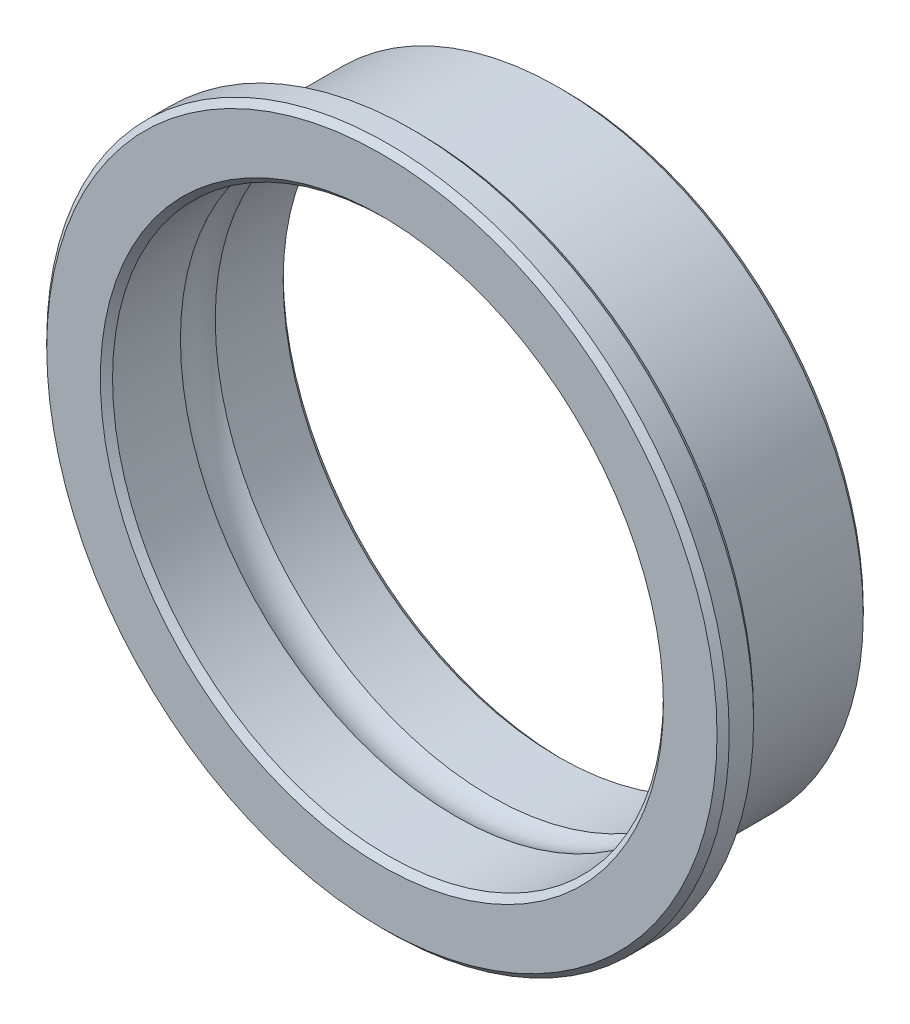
ISO-10303-21;
HEADER;
FILE_DESCRIPTION(('STEP AP214'),'2;1');
FILE_NAME('part.step','',(''),(''),'','','');
FILE_SCHEMA(('AUTOMOTIVE_DESIGN { 1 0 10303 214 1 1 1 1 }'));
ENDSEC;
DATA;
#1=APPLICATION_CONTEXT('core data for automotive mechanical design processes');
#2=APPLICATION_PROTOCOL_DEFINITION('international standard','automotive_design',2000,#1);
#3=PRODUCT_CONTEXT('',#1,'mechanical');
#4=PRODUCT('Part','Part','',(#3));
#5=PRODUCT_RELATED_PRODUCT_CATEGORY('part','',(#4));
#6=PRODUCT_DEFINITION_FORMATION('','',#4);
#7=PRODUCT_DEFINITION_CONTEXT('part definition',#1,'design');
#8=PRODUCT_DEFINITION('design','',#6,#7);
#9=PRODUCT_DEFINITION_SHAPE('','',#8);
#10=(LENGTH_UNIT() NAMED_UNIT(*) SI_UNIT(.MILLI.,.METRE.));
#11=(NAMED_UNIT(*) PLANE_ANGLE_UNIT() SI_UNIT($,.RADIAN.));
#12=(NAMED_UNIT(*) SI_UNIT($,.STERADIAN.) SOLID_ANGLE_UNIT());
#13=UNCERTAINTY_MEASURE_WITH_UNIT(LENGTH_MEASURE(1.E-05),#10,'distance_accuracy_value','');
#14=(GEOMETRIC_REPRESENTATION_CONTEXT(3) GLOBAL_UNCERTAINTY_ASSIGNED_CONTEXT((#13)) GLOBAL_UNIT_ASSIGNED_CONTEXT((#10,
#11,#12)) REPRESENTATION_CONTEXT('',''));
#15=CARTESIAN_POINT('',(0.,0.,0.));
#16=DIRECTION('',(0.,0.,1.));
#17=DIRECTION('',(1.,0.,0.));
#18=AXIS2_PLACEMENT_3D('',#15,#16,#17);
#19=CARTESIAN_POINT('',(0.,0.,0.));
#20=DIRECTION('',(0.,0.,1.));
#21=DIRECTION('',(1.,0.,0.));
#22=AXIS2_PLACEMENT_3D('',#19,#20,#21);
#23=CYLINDRICAL_SURFACE('',#22,4.52);
#24=CARTESIAN_POINT('',(0.,0.,1.40000000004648));
#25=DIRECTION('',(0.,0.,1.));
#26=DIRECTION('',(1.,0.,0.));
#27=AXIS2_PLACEMENT_3D('',#24,#25,#26);
#28=CIRCLE('',#27,4.52000000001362);
#29=CARTESIAN_POINT('',(4.52000000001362,0.,1.40000000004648));
#30=VERTEX_POINT('',#29);
#31=EDGE_CURVE('E32',#30,#30,#28,.T.);
#32=ORIENTED_EDGE('',*,*,#31,.T.);
#33=EDGE_LOOP('',(#32));
#34=FACE_BOUND('',#33,.T.);
#35=CARTESIAN_POINT('',(0.,0.,0.285681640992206));
#36=DIRECTION('',(0.,0.,1.));
#37=DIRECTION('',(1.,0.,0.));
#38=AXIS2_PLACEMENT_3D('',#35,#36,#37);
#39=CIRCLE('',#38,4.52);
#40=CARTESIAN_POINT('',(4.52,0.,0.285681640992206));
#41=VERTEX_POINT('',#40);
#42=EDGE_CURVE('E56',#41,#41,#39,.F.);
#43=ORIENTED_EDGE('',*,*,#42,.T.);
#44=EDGE_LOOP('',(#43));
#45=FACE_BOUND('',#44,.T.);
#46=ADVANCED_FACE('F15',(#34,#45),#23,.F.);
#47=CARTESIAN_POINT('',(0.,0.,1.49999999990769));
#48=DIRECTION('',(0.,0.,1.));
#49=DIRECTION('',(1.,0.,0.));
#50=AXIS2_PLACEMENT_3D('',#47,#48,#49);
#51=CONICAL_SURFACE('',#50,4.61999999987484,0.785398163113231);
#52=CARTESIAN_POINT('',(0.,0.,1.49999999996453));
#53=DIRECTION('',(0.,0.,1.));
#54=DIRECTION('',(1.,0.,0.));
#55=AXIS2_PLACEMENT_3D('',#52,#53,#54);
#56=CIRCLE('',#55,4.61999999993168);
#57=CARTESIAN_POINT('',(4.61999999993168,0.,1.49999999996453));
#58=VERTEX_POINT('',#57);
#59=EDGE_CURVE('E19',#58,#58,#56,.T.);
#60=ORIENTED_EDGE('',*,*,#59,.T.);
#61=EDGE_LOOP('',(#60));
#62=FACE_BOUND('',#61,.T.);
#63=ORIENTED_EDGE('',*,*,#31,.F.);
#64=EDGE_LOOP('',(#63));
#65=FACE_BOUND('',#64,.T.);
#66=ADVANCED_FACE('F65',(#62,#65),#51,.F.);
#67=CARTESIAN_POINT('',(0.,0.,0.));
#68=DIRECTION('',(0.,0.,1.));
#69=DIRECTION('',(1.,0.,0.));
#70=AXIS2_PLACEMENT_3D('',#67,#68,#69);
#71=TOROIDAL_SURFACE('',#70,3.9975,0.5955);
#72=ORIENTED_EDGE('',*,*,#42,.F.);
#73=EDGE_LOOP('',(#72));
#74=FACE_BOUND('',#73,.T.);
#75=CARTESIAN_POINT('',(0.,0.,-0.285681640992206));
#76=DIRECTION('',(0.,0.,1.));
#77=DIRECTION('',(1.,0.,0.));
#78=AXIS2_PLACEMENT_3D('',#75,#76,#77);
#79=CIRCLE('',#78,4.52);
#80=CARTESIAN_POINT('',(4.52,0.,-0.285681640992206));
#81=VERTEX_POINT('',#80);
#82=EDGE_CURVE('E46',#81,#81,#79,.F.);
#83=ORIENTED_EDGE('',*,*,#82,.T.);
#84=EDGE_LOOP('',(#83));
#85=FACE_BOUND('',#84,.T.);
#86=ADVANCED_FACE('F67',(#74,#85),#71,.F.);
#87=CARTESIAN_POINT('',(0.,5.6,1.5));
#88=DIRECTION('',(0.,0.,-1.));
#89=DIRECTION('',(-1.,0.,0.));
#90=AXIS2_PLACEMENT_3D('',#87,#88,#89);
#91=PLANE('',#90);
#92=CARTESIAN_POINT('',(0.,0.,1.49999999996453));
#93=DIRECTION('',(0.,0.,-1.));
#94=DIRECTION('',(-1.,0.,0.));
#95=AXIS2_PLACEMENT_3D('',#92,#93,#94);
#96=CIRCLE('',#95,5.49999999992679);
#97=CARTESIAN_POINT('',(-5.49999999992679,0.,1.49999999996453));
#98=VERTEX_POINT('',#97);
#99=EDGE_CURVE('E43',#98,#98,#96,.T.);
#100=ORIENTED_EDGE('',*,*,#99,.F.);
#101=EDGE_LOOP('',(#100));
#102=FACE_BOUND('',#101,.T.);
#103=ORIENTED_EDGE('',*,*,#59,.F.);
#104=EDGE_LOOP('',(#103));
#105=FACE_BOUND('',#104,.T.);
#106=ADVANCED_FACE('F75',(#102,#105),#91,.F.);
#107=CARTESIAN_POINT('',(0.,0.,0.));
#108=DIRECTION('',(0.,0.,1.));
#109=DIRECTION('',(1.,0.,0.));
#110=AXIS2_PLACEMENT_3D('',#107,#108,#109);
#111=CYLINDRICAL_SURFACE('',#110,4.52);
#112=ORIENTED_EDGE('',*,*,#82,.F.);
#113=EDGE_LOOP('',(#112));
#114=FACE_BOUND('',#113,.T.);
#115=CARTESIAN_POINT('',(0.,0.,-1.40000000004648));
#116=DIRECTION('',(0.,0.,-1.));
#117=DIRECTION('',(-1.,0.,0.));
#118=AXIS2_PLACEMENT_3D('',#115,#116,#117);
#119=CIRCLE('',#118,4.52000000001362);
#120=CARTESIAN_POINT('',(-4.52000000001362,0.,-1.40000000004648));
#121=VERTEX_POINT('',#120);
#122=EDGE_CURVE('E45',#121,#121,#119,.T.);
#123=ORIENTED_EDGE('',*,*,#122,.T.);
#124=EDGE_LOOP('',(#123));
#125=FACE_BOUND('',#124,.T.);
#126=ADVANCED_FACE('F117',(#114,#125),#111,.F.);
#127=CARTESIAN_POINT('',(0.,0.,1.39999999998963));
#128=DIRECTION('',(0.,0.,-1.));
#129=DIRECTION('',(-1.,0.,0.));
#130=AXIS2_PLACEMENT_3D('',#127,#128,#129);
#131=CONICAL_SURFACE('',#130,5.59999999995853,0.785398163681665);
#132=ORIENTED_EDGE('',*,*,#99,.T.);
#133=EDGE_LOOP('',(#132));
#134=FACE_BOUND('',#133,.T.);
#135=CARTESIAN_POINT('',(0.,0.,1.4));
#136=DIRECTION('',(0.,0.,1.));
#137=DIRECTION('',(1.,0.,0.));
#138=AXIS2_PLACEMENT_3D('',#135,#136,#137);
#139=CIRCLE('',#138,5.6);
#140=CARTESIAN_POINT('',(5.6,0.,1.4));
#141=VERTEX_POINT('',#140);
#142=EDGE_CURVE('E42',#141,#141,#139,.F.);
#143=ORIENTED_EDGE('',*,*,#142,.F.);
#144=EDGE_LOOP('',(#143));
#145=FACE_BOUND('',#144,.T.);
#146=ADVANCED_FACE('F113',(#134,#145),#131,.T.);
#147=CARTESIAN_POINT('',(0.,0.,-1.499999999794));
#148=DIRECTION('',(0.,0.,-1.));
#149=DIRECTION('',(-1.,0.,0.));
#150=AXIS2_PLACEMENT_3D('',#147,#148,#149);
#151=CONICAL_SURFACE('',#150,4.61999999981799,0.785398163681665);
#152=CARTESIAN_POINT('',(0.,0.,-1.49999999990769));
#153=DIRECTION('',(0.,0.,-1.));
#154=DIRECTION('',(-1.,0.,0.));
#155=AXIS2_PLACEMENT_3D('',#152,#153,#154);
#156=CIRCLE('',#155,4.61999999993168);
#157=CARTESIAN_POINT('',(-4.61999999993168,0.,-1.49999999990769));
#158=VERTEX_POINT('',#157);
#159=EDGE_CURVE('E40',#158,#158,#156,.T.);
#160=ORIENTED_EDGE('',*,*,#159,.T.);
#161=EDGE_LOOP('',(#160));
#162=FACE_BOUND('',#161,.T.);
#163=ORIENTED_EDGE('',*,*,#122,.F.);
#164=EDGE_LOOP('',(#163));
#165=FACE_BOUND('',#164,.T.);
#166=ADVANCED_FACE('F109',(#162,#165),#151,.F.);
#167=CARTESIAN_POINT('',(0.,0.,0.));
#168=DIRECTION('',(0.,0.,1.));
#169=DIRECTION('',(1.,0.,0.));
#170=AXIS2_PLACEMENT_3D('',#167,#168,#169);
#171=CYLINDRICAL_SURFACE('',#170,5.6);
#172=CARTESIAN_POINT('',(0.,0.,0.99999999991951));
#173=DIRECTION('',(0.,0.,1.));
#174=DIRECTION('',(1.,0.,0.));
#175=AXIS2_PLACEMENT_3D('',#172,#173,#174);
#176=CIRCLE('',#175,5.60000000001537);
#177=CARTESIAN_POINT('',(5.60000000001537,0.,0.99999999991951));
#178=VERTEX_POINT('',#177);
#179=EDGE_CURVE('E39',#178,#178,#176,.F.);
#180=ORIENTED_EDGE('',*,*,#179,.F.);
#181=EDGE_LOOP('',(#180));
#182=FACE_BOUND('',#181,.T.);
#183=ORIENTED_EDGE('',*,*,#142,.T.);
#184=EDGE_LOOP('',(#183));
#185=FACE_BOUND('',#184,.T.);
#186=ADVANCED_FACE('F105',(#182,#185),#171,.T.);
#187=CARTESIAN_POINT('',(0.,5.,-1.5));
#188=DIRECTION('',(0.,0.,1.));
#189=DIRECTION('',(1.,0.,0.));
#190=AXIS2_PLACEMENT_3D('',#187,#188,#189);
#191=PLANE('',#190);
#192=ORIENTED_EDGE('',*,*,#159,.F.);
#193=EDGE_LOOP('',(#192));
#194=FACE_BOUND('',#193,.T.);
#195=CARTESIAN_POINT('',(0.,0.,-1.49999999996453));
#196=DIRECTION('',(0.,0.,1.));
#197=DIRECTION('',(1.,0.,0.));
#198=AXIS2_PLACEMENT_3D('',#195,#196,#197);
#199=CIRCLE('',#198,4.89999999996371);
#200=CARTESIAN_POINT('',(4.89999999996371,0.,-1.49999999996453));
#201=VERTEX_POINT('',#200);
#202=EDGE_CURVE('E36',#201,#201,#199,.T.);
#203=ORIENTED_EDGE('',*,*,#202,.F.);
#204=EDGE_LOOP('',(#203));
#205=FACE_BOUND('',#204,.T.);
#206=ADVANCED_FACE('F99',(#194,#205),#191,.F.);
#207=CARTESIAN_POINT('',(0.,0.,0.999999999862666));
#208=DIRECTION('',(0.,0.,1.));
#209=DIRECTION('',(1.,0.,0.));
#210=AXIS2_PLACEMENT_3D('',#207,#208,#209);
#211=CONICAL_SURFACE('',#210,5.59999999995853,0.785398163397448);
#212=CARTESIAN_POINT('',(0.,0.,0.899999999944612));
#213=DIRECTION('',(0.,0.,1.));
#214=DIRECTION('',(1.,0.,0.));
#215=AXIS2_PLACEMENT_3D('',#212,#213,#214);
#216=CIRCLE('',#215,5.50000000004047);
#217=CARTESIAN_POINT('',(5.50000000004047,0.,0.899999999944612));
#218=VERTEX_POINT('',#217);
#219=EDGE_CURVE('E28',#218,#218,#216,.T.);
#220=ORIENTED_EDGE('',*,*,#219,.T.);
#221=EDGE_LOOP('',(#220));
#222=FACE_BOUND('',#221,.T.);
#223=ORIENTED_EDGE('',*,*,#179,.T.);
#224=EDGE_LOOP('',(#223));
#225=FACE_BOUND('',#224,.T.);
#226=ADVANCED_FACE('F92',(#222,#225),#211,.T.);
#227=CARTESIAN_POINT('',(0.,0.,-1.40000000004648));
#228=DIRECTION('',(0.,0.,1.));
#229=DIRECTION('',(1.,0.,0.));
#230=AXIS2_PLACEMENT_3D('',#227,#228,#229);
#231=CONICAL_SURFACE('',#230,4.99999999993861,0.785398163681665);
#232=ORIENTED_EDGE('',*,*,#202,.T.);
#233=EDGE_LOOP('',(#232));
#234=FACE_BOUND('',#233,.T.);
#235=CARTESIAN_POINT('',(0.,0.,-1.4));
#236=DIRECTION('',(0.,0.,1.));
#237=DIRECTION('',(1.,0.,0.));
#238=AXIS2_PLACEMENT_3D('',#235,#236,#237);
#239=CIRCLE('',#238,5.);
#240=CARTESIAN_POINT('',(5.,0.,-1.4));
#241=VERTEX_POINT('',#240);
#242=EDGE_CURVE('E23',#241,#241,#239,.T.);
#243=ORIENTED_EDGE('',*,*,#242,.F.);
#244=EDGE_LOOP('',(#243));
#245=FACE_BOUND('',#244,.T.);
#246=ADVANCED_FACE('F87',(#234,#245),#231,.T.);
#247=CARTESIAN_POINT('',(0.,5.,0.9));
#248=DIRECTION('',(0.,0.,1.));
#249=DIRECTION('',(1.,0.,0.));
#250=AXIS2_PLACEMENT_3D('',#247,#248,#249);
#251=PLANE('',#250);
#252=CARTESIAN_POINT('',(0.,0.,0.9));
#253=DIRECTION('',(0.,0.,1.));
#254=DIRECTION('',(1.,0.,0.));
#255=AXIS2_PLACEMENT_3D('',#252,#253,#254);
#256=CIRCLE('',#255,5.);
#257=CARTESIAN_POINT('',(5.,0.,0.9));
#258=VERTEX_POINT('',#257);
#259=EDGE_CURVE('E10',#258,#258,#256,.F.);
#260=ORIENTED_EDGE('',*,*,#259,.F.);
#261=EDGE_LOOP('',(#260));
#262=FACE_BOUND('',#261,.T.);
#263=ORIENTED_EDGE('',*,*,#219,.F.);
#264=EDGE_LOOP('',(#263));
#265=FACE_BOUND('',#264,.T.);
#266=ADVANCED_FACE('F81',(#262,#265),#251,.F.);
#267=CARTESIAN_POINT('',(0.,0.,0.));
#268=DIRECTION('',(0.,0.,1.));
#269=DIRECTION('',(1.,0.,0.));
#270=AXIS2_PLACEMENT_3D('',#267,#268,#269);
#271=CYLINDRICAL_SURFACE('',#270,5.);
#272=ORIENTED_EDGE('',*,*,#242,.T.);
#273=EDGE_LOOP('',(#272));
#274=FACE_BOUND('',#273,.T.);
#275=ORIENTED_EDGE('',*,*,#259,.T.);
#276=EDGE_LOOP('',(#275));
#277=FACE_BOUND('',#276,.T.);
#278=ADVANCED_FACE('F17',(#274,#277),#271,.T.);
#279=CLOSED_SHELL('',(#46,#66,#86,#106,#126,#146,#166,#186,#206,#226,#246,#266,#278));
#280=MANIFOLD_SOLID_BREP('B1',#279);
#281=ADVANCED_BREP_SHAPE_REPRESENTATION('',(#18,#280),#14);
#282=SHAPE_DEFINITION_REPRESENTATION(#9,#281);
ENDSEC;
END-ISO-10303-21;
